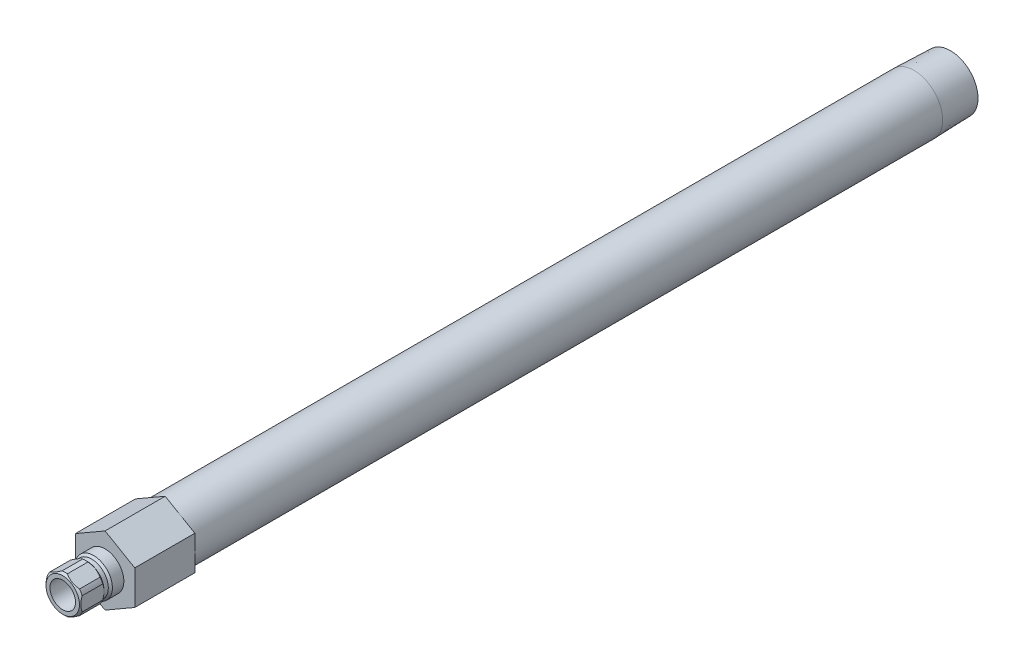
from build123d import *

# Parameters (mm, degrees)
SKETCH2_R           = 4.7625
BOSS_EXTRUDE1_DEPTH = 22.352
CUT_EXTRUDE1_START  = 6.604
SKETCH3_OUTSIDE_W   = 90.482
SKETCH3_OUTSIDE_H   = 93.9
CUT_EXTRUDE1_DEPTH  = 309.300611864


with BuildPart() as part:
    # Sketch1 → Revolve1 (revolve)
    with BuildSketch(Plane(origin=(0, 0, 0), x_dir=(0, 0, -1), z_dir=(1, 0, 0))):
        Polygon((-15.748, 4.7625), (-15.748, 6.223), (-14.986, 6.985), (-7.366, 6.985), (-6.604, 6.223), (-5.0165, 6.223), (-4.2545, 6.985), (0, 6.985), (0, 10.668), (300.8884, 10.668), (314.452, 10.244140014), (314.452, 7.8994), (22.352, 7.8994), (22.352, 4.7625), align=None)
    revolve(axis=Axis((0, 0, 13.122373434), (0, 0, 1)))

    # Sketch2 → Boss-Extrude1 (add)
    with BuildSketch(Plane.XY):
        Polygon((-11.049, 6.379143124), (-11.049, -6.379143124), (0, -12.758286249), (11.049, -6.379143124), (11.049, 6.379143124), (0, 12.758286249), align=None)
        with Locations(Location((0, 0, 0), (0, 0, 90))):
            Circle(SKETCH2_R, mode=Mode.SUBTRACT)
    extrude(amount=-BOSS_EXTRUDE1_DEPTH)

    # Sketch3 outside → Cut-Extrude1 (cut, through all)
    with BuildSketch(Plane.XY.offset(CUT_EXTRUDE1_START)):
        Rectangle(SKETCH3_OUTSIDE_W, SKETCH3_OUTSIDE_H)
        Polygon((6.477, -3.739497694), (6.477, 3.739497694), (0, 7.478995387), (-6.477, 3.739497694), (-6.477, -3.739497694), (0, -7.478995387), align=None, mode=Mode.SUBTRACT)
    extrude(amount=CUT_EXTRUDE1_DEPTH, mode=Mode.SUBTRACT)


solid = part.part
